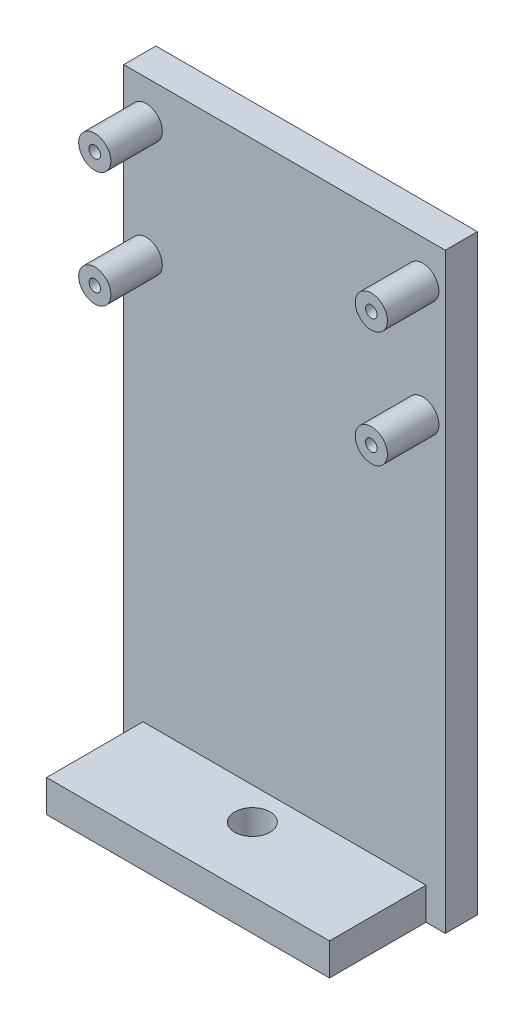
ISO-10303-21;
HEADER;
FILE_DESCRIPTION(('STEP AP214'),'2;1');
FILE_NAME('part.step','',(''),(''),'','','');
FILE_SCHEMA(('AUTOMOTIVE_DESIGN { 1 0 10303 214 1 1 1 1 }'));
ENDSEC;
DATA;
#1=APPLICATION_CONTEXT('core data for automotive mechanical design processes');
#2=APPLICATION_PROTOCOL_DEFINITION('international standard','automotive_design',2000,#1);
#3=PRODUCT_CONTEXT('',#1,'mechanical');
#4=PRODUCT('Part','Part','',(#3));
#5=PRODUCT_RELATED_PRODUCT_CATEGORY('part','',(#4));
#6=PRODUCT_DEFINITION_FORMATION('','',#4);
#7=PRODUCT_DEFINITION_CONTEXT('part definition',#1,'design');
#8=PRODUCT_DEFINITION('design','',#6,#7);
#9=PRODUCT_DEFINITION_SHAPE('','',#8);
#10=(LENGTH_UNIT() NAMED_UNIT(*) SI_UNIT(.MILLI.,.METRE.));
#11=(NAMED_UNIT(*) PLANE_ANGLE_UNIT() SI_UNIT($,.RADIAN.));
#12=(NAMED_UNIT(*) SI_UNIT($,.STERADIAN.) SOLID_ANGLE_UNIT());
#13=UNCERTAINTY_MEASURE_WITH_UNIT(LENGTH_MEASURE(1.E-05),#10,'distance_accuracy_value','');
#14=(GEOMETRIC_REPRESENTATION_CONTEXT(3) GLOBAL_UNCERTAINTY_ASSIGNED_CONTEXT((#13)) GLOBAL_UNIT_ASSIGNED_CONTEXT((#10,
#11,#12)) REPRESENTATION_CONTEXT('',''));
#15=CARTESIAN_POINT('',(0.,0.,0.));
#16=DIRECTION('',(0.,0.,1.));
#17=DIRECTION('',(1.,0.,0.));
#18=AXIS2_PLACEMENT_3D('',#15,#16,#17);
#19=CARTESIAN_POINT('',(25.,46.,5.));
#20=DIRECTION('',(-1.,0.,0.));
#21=DIRECTION('',(0.,-1.,0.));
#22=AXIS2_PLACEMENT_3D('',#19,#20,#21);
#23=PLANE('',#22);
#24=DIRECTION('',(0.,1.,0.));
#25=VECTOR('',#24,1.);
#26=CARTESIAN_POINT('',(25.,46.,0.));
#27=LINE('',#26,#25);
#28=CARTESIAN_POINT('',(25.,-46.,0.));
#29=VERTEX_POINT('',#28);
#30=CARTESIAN_POINT('',(25.,46.,0.));
#31=VERTEX_POINT('',#30);
#32=EDGE_CURVE('E123',#29,#31,#27,.T.);
#33=ORIENTED_EDGE('',*,*,#32,.T.);
#34=DIRECTION('',(0.,0.,-1.));
#35=VECTOR('',#34,1.);
#36=CARTESIAN_POINT('',(25.,46.,5.));
#37=LINE('',#36,#35);
#38=CARTESIAN_POINT('',(25.,46.,5.));
#39=VERTEX_POINT('',#38);
#40=EDGE_CURVE('E11',#39,#31,#37,.T.);
#41=ORIENTED_EDGE('',*,*,#40,.F.);
#42=DIRECTION('',(0.,1.,0.));
#43=VECTOR('',#42,1.);
#44=CARTESIAN_POINT('',(25.,46.,5.));
#45=LINE('',#44,#43);
#46=CARTESIAN_POINT('',(25.,-46.,5.));
#47=VERTEX_POINT('',#46);
#48=EDGE_CURVE('E132',#47,#39,#45,.T.);
#49=ORIENTED_EDGE('',*,*,#48,.F.);
#50=DIRECTION('',(0.,0.,-1.));
#51=VECTOR('',#50,1.);
#52=CARTESIAN_POINT('',(25.,-46.,5.));
#53=LINE('',#52,#51);
#54=EDGE_CURVE('E142',#47,#29,#53,.T.);
#55=ORIENTED_EDGE('',*,*,#54,.T.);
#56=EDGE_LOOP('',(#33,#41,#49,#55));
#57=FACE_BOUND('',#56,.T.);
#58=ADVANCED_FACE('F37',(#57),#23,.F.);
#59=CARTESIAN_POINT('',(-25.,46.,5.));
#60=DIRECTION('',(0.,-1.,0.));
#61=DIRECTION('',(0.,0.,-1.));
#62=AXIS2_PLACEMENT_3D('',#59,#60,#61);
#63=PLANE('',#62);
#64=DIRECTION('',(-1.,0.,0.));
#65=VECTOR('',#64,1.);
#66=CARTESIAN_POINT('',(-25.,46.,0.));
#67=LINE('',#66,#65);
#68=CARTESIAN_POINT('',(-25.,46.,0.));
#69=VERTEX_POINT('',#68);
#70=EDGE_CURVE('E126',#31,#69,#67,.T.);
#71=ORIENTED_EDGE('',*,*,#70,.T.);
#72=DIRECTION('',(0.,0.,-1.));
#73=VECTOR('',#72,1.);
#74=CARTESIAN_POINT('',(-25.,46.,5.));
#75=LINE('',#74,#73);
#76=CARTESIAN_POINT('',(-25.,46.,5.));
#77=VERTEX_POINT('',#76);
#78=EDGE_CURVE('E44',#77,#69,#75,.T.);
#79=ORIENTED_EDGE('',*,*,#78,.F.);
#80=DIRECTION('',(-1.,0.,0.));
#81=VECTOR('',#80,1.);
#82=CARTESIAN_POINT('',(-25.,46.,5.));
#83=LINE('',#82,#81);
#84=EDGE_CURVE('E135',#39,#77,#83,.T.);
#85=ORIENTED_EDGE('',*,*,#84,.F.);
#86=ORIENTED_EDGE('',*,*,#40,.T.);
#87=EDGE_LOOP('',(#71,#79,#85,#86));
#88=FACE_BOUND('',#87,.T.);
#89=ADVANCED_FACE('F195',(#88),#63,.F.);
#90=CARTESIAN_POINT('',(-25.,46.,5.));
#91=DIRECTION('',(1.,0.,0.));
#92=DIRECTION('',(0.,1.,0.));
#93=AXIS2_PLACEMENT_3D('',#90,#91,#92);
#94=PLANE('',#93);
#95=DIRECTION('',(0.,-1.,0.));
#96=VECTOR('',#95,1.);
#97=CARTESIAN_POINT('',(-25.,46.,0.));
#98=LINE('',#97,#96);
#99=CARTESIAN_POINT('',(-25.,-46.,0.));
#100=VERTEX_POINT('',#99);
#101=EDGE_CURVE('E145',#69,#100,#98,.T.);
#102=ORIENTED_EDGE('',*,*,#101,.T.);
#103=DIRECTION('',(0.,0.,-1.));
#104=VECTOR('',#103,1.);
#105=CARTESIAN_POINT('',(-25.,-46.,5.));
#106=LINE('',#105,#104);
#107=CARTESIAN_POINT('',(-25.,-46.,5.));
#108=VERTEX_POINT('',#107);
#109=EDGE_CURVE('E150',#108,#100,#106,.T.);
#110=ORIENTED_EDGE('',*,*,#109,.F.);
#111=DIRECTION('',(0.,-1.,0.));
#112=VECTOR('',#111,1.);
#113=CARTESIAN_POINT('',(-25.,46.,5.));
#114=LINE('',#113,#112);
#115=EDGE_CURVE('E138',#77,#108,#114,.T.);
#116=ORIENTED_EDGE('',*,*,#115,.F.);
#117=ORIENTED_EDGE('',*,*,#78,.T.);
#118=EDGE_LOOP('',(#102,#110,#116,#117));
#119=FACE_BOUND('',#118,.T.);
#120=ADVANCED_FACE('F157',(#119),#94,.F.);
#121=CARTESIAN_POINT('',(-25.,-46.,5.));
#122=DIRECTION('',(0.,1.,0.));
#123=DIRECTION('',(0.,0.,1.));
#124=AXIS2_PLACEMENT_3D('',#121,#122,#123);
#125=PLANE('',#124);
#126=CARTESIAN_POINT('',(0.,-46.,10.));
#127=DIRECTION('',(0.,1.,0.));
#128=DIRECTION('',(0.,0.,1.));
#129=AXIS2_PLACEMENT_3D('',#126,#127,#128);
#130=CIRCLE('',#129,2.75);
#131=CARTESIAN_POINT('',(0.,-46.,12.75));
#132=VERTEX_POINT('',#131);
#133=EDGE_CURVE('E178',#132,#132,#130,.T.);
#134=ORIENTED_EDGE('',*,*,#133,.T.);
#135=EDGE_LOOP('',(#134));
#136=FACE_BOUND('',#135,.T.);
#137=DIRECTION('',(1.,0.,0.));
#138=VECTOR('',#137,1.);
#139=CARTESIAN_POINT('',(-25.,-46.,0.));
#140=LINE('',#139,#138);
#141=EDGE_CURVE('E136',#100,#29,#140,.T.);
#142=ORIENTED_EDGE('',*,*,#141,.T.);
#143=ORIENTED_EDGE('',*,*,#54,.F.);
#144=DIRECTION('',(1.,0.,0.));
#145=VECTOR('',#144,1.);
#146=CARTESIAN_POINT('',(-25.,-46.,5.));
#147=LINE('',#146,#145);
#148=CARTESIAN_POINT('',(22.,-46.,5.));
#149=VERTEX_POINT('',#148);
#150=EDGE_CURVE('E140',#149,#47,#147,.T.);
#151=ORIENTED_EDGE('',*,*,#150,.F.);
#152=DIRECTION('',(0.,0.,-1.));
#153=VECTOR('',#152,1.);
#154=CARTESIAN_POINT('',(22.,-46.,20.));
#155=LINE('',#154,#153);
#156=CARTESIAN_POINT('',(22.,-46.,20.));
#157=VERTEX_POINT('',#156);
#158=EDGE_CURVE('E107',#157,#149,#155,.T.);
#159=ORIENTED_EDGE('',*,*,#158,.F.);
#160=DIRECTION('',(1.,0.,0.));
#161=VECTOR('',#160,1.);
#162=CARTESIAN_POINT('',(-22.,-46.,20.));
#163=LINE('',#162,#161);
#164=CARTESIAN_POINT('',(-22.,-46.,20.));
#165=VERTEX_POINT('',#164);
#166=EDGE_CURVE('E100',#165,#157,#163,.T.);
#167=ORIENTED_EDGE('',*,*,#166,.F.);
#168=DIRECTION('',(0.,0.,-1.));
#169=VECTOR('',#168,1.);
#170=CARTESIAN_POINT('',(-22.,-46.,20.));
#171=LINE('',#170,#169);
#172=CARTESIAN_POINT('',(-22.,-46.,5.));
#173=VERTEX_POINT('',#172);
#174=EDGE_CURVE('E105',#165,#173,#171,.T.);
#175=ORIENTED_EDGE('',*,*,#174,.T.);
#176=EDGE_CURVE('E141',#108,#173,#147,.T.);
#177=ORIENTED_EDGE('',*,*,#176,.F.);
#178=ORIENTED_EDGE('',*,*,#109,.T.);
#179=EDGE_LOOP('',(#142,#143,#151,#159,#167,#175,#177,#178));
#180=FACE_BOUND('',#179,.T.);
#181=ADVANCED_FACE('F102',(#136,#180),#125,.F.);
#182=CARTESIAN_POINT('',(0.,0.,5.));
#183=DIRECTION('',(0.,0.,1.));
#184=DIRECTION('',(1.,0.,0.));
#185=AXIS2_PLACEMENT_3D('',#182,#183,#184);
#186=PLANE('',#185);
#187=CARTESIAN_POINT('',(21.5,22.,5.));
#188=DIRECTION('',(0.,0.,1.));
#189=DIRECTION('',(1.,0.,0.));
#190=AXIS2_PLACEMENT_3D('',#187,#188,#189);
#191=CIRCLE('',#190,2.5);
#192=CARTESIAN_POINT('',(24.,22.,5.));
#193=VERTEX_POINT('',#192);
#194=EDGE_CURVE('E465',#193,#193,#191,.T.);
#195=ORIENTED_EDGE('',*,*,#194,.F.);
#196=EDGE_LOOP('',(#195));
#197=FACE_BOUND('',#196,.T.);
#198=CARTESIAN_POINT('',(21.5,40.,5.));
#199=DIRECTION('',(0.,0.,1.));
#200=DIRECTION('',(1.,0.,0.));
#201=AXIS2_PLACEMENT_3D('',#198,#199,#200);
#202=CIRCLE('',#201,2.5);
#203=CARTESIAN_POINT('',(24.,40.,5.));
#204=VERTEX_POINT('',#203);
#205=EDGE_CURVE('E474',#204,#204,#202,.T.);
#206=ORIENTED_EDGE('',*,*,#205,.F.);
#207=EDGE_LOOP('',(#206));
#208=FACE_BOUND('',#207,.T.);
#209=CARTESIAN_POINT('',(-21.5,22.,5.));
#210=DIRECTION('',(0.,0.,1.));
#211=DIRECTION('',(1.,0.,0.));
#212=AXIS2_PLACEMENT_3D('',#209,#210,#211);
#213=CIRCLE('',#212,2.5);
#214=CARTESIAN_POINT('',(-19.,22.,5.));
#215=VERTEX_POINT('',#214);
#216=EDGE_CURVE('E480',#215,#215,#213,.T.);
#217=ORIENTED_EDGE('',*,*,#216,.F.);
#218=EDGE_LOOP('',(#217));
#219=FACE_BOUND('',#218,.T.);
#220=CARTESIAN_POINT('',(-21.5,40.,5.));
#221=DIRECTION('',(0.,0.,1.));
#222=DIRECTION('',(1.,0.,0.));
#223=AXIS2_PLACEMENT_3D('',#220,#221,#222);
#224=CIRCLE('',#223,2.5);
#225=CARTESIAN_POINT('',(-19.,40.,5.));
#226=VERTEX_POINT('',#225);
#227=EDGE_CURVE('E483',#226,#226,#224,.T.);
#228=ORIENTED_EDGE('',*,*,#227,.F.);
#229=EDGE_LOOP('',(#228));
#230=FACE_BOUND('',#229,.T.);
#231=DIRECTION('',(0.,-1.,0.));
#232=VECTOR('',#231,1.);
#233=CARTESIAN_POINT('',(-22.,-46.,5.));
#234=LINE('',#233,#232);
#235=CARTESIAN_POINT('',(-22.,-41.,5.));
#236=VERTEX_POINT('',#235);
#237=EDGE_CURVE('E51',#236,#173,#234,.T.);
#238=ORIENTED_EDGE('',*,*,#237,.F.);
#239=DIRECTION('',(-1.,0.,0.));
#240=VECTOR('',#239,1.);
#241=CARTESIAN_POINT('',(-22.,-41.,5.));
#242=LINE('',#241,#240);
#243=CARTESIAN_POINT('',(22.,-41.,5.));
#244=VERTEX_POINT('',#243);
#245=EDGE_CURVE('E120',#244,#236,#242,.T.);
#246=ORIENTED_EDGE('',*,*,#245,.F.);
#247=DIRECTION('',(0.,1.,0.));
#248=VECTOR('',#247,1.);
#249=CARTESIAN_POINT('',(22.,-46.,5.));
#250=LINE('',#249,#248);
#251=EDGE_CURVE('E57',#149,#244,#250,.T.);
#252=ORIENTED_EDGE('',*,*,#251,.F.);
#253=ORIENTED_EDGE('',*,*,#150,.T.);
#254=ORIENTED_EDGE('',*,*,#48,.T.);
#255=ORIENTED_EDGE('',*,*,#84,.T.);
#256=ORIENTED_EDGE('',*,*,#115,.T.);
#257=ORIENTED_EDGE('',*,*,#176,.T.);
#258=EDGE_LOOP('',(#238,#246,#252,#253,#254,#255,#256,#257));
#259=FACE_BOUND('',#258,.T.);
#260=ADVANCED_FACE('F168',(#197,#208,#219,#230,#259),#186,.T.);
#261=CARTESIAN_POINT('',(0.,0.,0.));
#262=DIRECTION('',(0.,0.,1.));
#263=DIRECTION('',(1.,0.,0.));
#264=AXIS2_PLACEMENT_3D('',#261,#262,#263);
#265=PLANE('',#264);
#266=CARTESIAN_POINT('',(-21.5,40.,0.));
#267=DIRECTION('',(0.,0.,1.));
#268=DIRECTION('',(1.,0.,0.));
#269=AXIS2_PLACEMENT_3D('',#266,#267,#268);
#270=CIRCLE('',#269,0.899999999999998);
#271=CARTESIAN_POINT('',(-20.6,40.,0.));
#272=VERTEX_POINT('',#271);
#273=EDGE_CURVE('E489',#272,#272,#270,.T.);
#274=ORIENTED_EDGE('',*,*,#273,.T.);
#275=EDGE_LOOP('',(#274));
#276=FACE_BOUND('',#275,.T.);
#277=CARTESIAN_POINT('',(21.5,40.,0.));
#278=DIRECTION('',(0.,0.,1.));
#279=DIRECTION('',(1.,0.,0.));
#280=AXIS2_PLACEMENT_3D('',#277,#278,#279);
#281=CIRCLE('',#280,0.899999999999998);
#282=CARTESIAN_POINT('',(22.4,40.,0.));
#283=VERTEX_POINT('',#282);
#284=EDGE_CURVE('E494',#283,#283,#281,.T.);
#285=ORIENTED_EDGE('',*,*,#284,.T.);
#286=EDGE_LOOP('',(#285));
#287=FACE_BOUND('',#286,.T.);
#288=CARTESIAN_POINT('',(21.5,22.,0.));
#289=DIRECTION('',(0.,0.,1.));
#290=DIRECTION('',(1.,0.,0.));
#291=AXIS2_PLACEMENT_3D('',#288,#289,#290);
#292=CIRCLE('',#291,0.899999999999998);
#293=CARTESIAN_POINT('',(22.4,22.,0.));
#294=VERTEX_POINT('',#293);
#295=EDGE_CURVE('E497',#294,#294,#292,.T.);
#296=ORIENTED_EDGE('',*,*,#295,.T.);
#297=EDGE_LOOP('',(#296));
#298=FACE_BOUND('',#297,.T.);
#299=CARTESIAN_POINT('',(-21.5,22.,0.));
#300=DIRECTION('',(0.,0.,1.));
#301=DIRECTION('',(1.,0.,0.));
#302=AXIS2_PLACEMENT_3D('',#299,#300,#301);
#303=CIRCLE('',#302,0.899999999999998);
#304=CARTESIAN_POINT('',(-20.6,22.,0.));
#305=VERTEX_POINT('',#304);
#306=EDGE_CURVE('E500',#305,#305,#303,.T.);
#307=ORIENTED_EDGE('',*,*,#306,.T.);
#308=EDGE_LOOP('',(#307));
#309=FACE_BOUND('',#308,.T.);
#310=ORIENTED_EDGE('',*,*,#32,.F.);
#311=ORIENTED_EDGE('',*,*,#141,.F.);
#312=ORIENTED_EDGE('',*,*,#101,.F.);
#313=ORIENTED_EDGE('',*,*,#70,.F.);
#314=EDGE_LOOP('',(#310,#311,#312,#313));
#315=FACE_BOUND('',#314,.T.);
#316=ADVANCED_FACE('F163',(#276,#287,#298,#309,#315),#265,.F.);
#317=CARTESIAN_POINT('',(-22.,-46.,20.));
#318=DIRECTION('',(1.,0.,0.));
#319=DIRECTION('',(0.,0.,-1.));
#320=AXIS2_PLACEMENT_3D('',#317,#318,#319);
#321=PLANE('',#320);
#322=ORIENTED_EDGE('',*,*,#237,.T.);
#323=ORIENTED_EDGE('',*,*,#174,.F.);
#324=DIRECTION('',(0.,-1.,0.));
#325=VECTOR('',#324,1.);
#326=CARTESIAN_POINT('',(-22.,-46.,20.));
#327=LINE('',#326,#325);
#328=CARTESIAN_POINT('',(-22.,-41.,20.));
#329=VERTEX_POINT('',#328);
#330=EDGE_CURVE('E111',#329,#165,#327,.T.);
#331=ORIENTED_EDGE('',*,*,#330,.F.);
#332=DIRECTION('',(0.,0.,-1.));
#333=VECTOR('',#332,1.);
#334=CARTESIAN_POINT('',(-22.,-41.,20.));
#335=LINE('',#334,#333);
#336=EDGE_CURVE('E174',#329,#236,#335,.T.);
#337=ORIENTED_EDGE('',*,*,#336,.T.);
#338=EDGE_LOOP('',(#322,#323,#331,#337));
#339=FACE_BOUND('',#338,.T.);
#340=ADVANCED_FACE('F122',(#339),#321,.F.);
#341=CARTESIAN_POINT('',(22.,-46.,20.));
#342=DIRECTION('',(-1.,0.,0.));
#343=DIRECTION('',(0.,0.,1.));
#344=AXIS2_PLACEMENT_3D('',#341,#342,#343);
#345=PLANE('',#344);
#346=ORIENTED_EDGE('',*,*,#251,.T.);
#347=DIRECTION('',(0.,0.,-1.));
#348=VECTOR('',#347,1.);
#349=CARTESIAN_POINT('',(22.,-41.,20.));
#350=LINE('',#349,#348);
#351=CARTESIAN_POINT('',(22.,-41.,20.));
#352=VERTEX_POINT('',#351);
#353=EDGE_CURVE('E128',#352,#244,#350,.T.);
#354=ORIENTED_EDGE('',*,*,#353,.F.);
#355=DIRECTION('',(0.,1.,0.));
#356=VECTOR('',#355,1.);
#357=CARTESIAN_POINT('',(22.,-46.,20.));
#358=LINE('',#357,#356);
#359=EDGE_CURVE('E110',#157,#352,#358,.T.);
#360=ORIENTED_EDGE('',*,*,#359,.F.);
#361=ORIENTED_EDGE('',*,*,#158,.T.);
#362=EDGE_LOOP('',(#346,#354,#360,#361));
#363=FACE_BOUND('',#362,.T.);
#364=ADVANCED_FACE('F170',(#363),#345,.F.);
#365=CARTESIAN_POINT('',(-22.,-41.,20.));
#366=DIRECTION('',(0.,-1.,0.));
#367=DIRECTION('',(0.,0.,-1.));
#368=AXIS2_PLACEMENT_3D('',#365,#366,#367);
#369=PLANE('',#368);
#370=CARTESIAN_POINT('',(0.,-41.,10.));
#371=DIRECTION('',(0.,1.,0.));
#372=DIRECTION('',(0.,0.,1.));
#373=AXIS2_PLACEMENT_3D('',#370,#371,#372);
#374=CIRCLE('',#373,2.75);
#375=CARTESIAN_POINT('',(0.,-41.,12.75));
#376=VERTEX_POINT('',#375);
#377=EDGE_CURVE('E503',#376,#376,#374,.T.);
#378=ORIENTED_EDGE('',*,*,#377,.F.);
#379=EDGE_LOOP('',(#378));
#380=FACE_BOUND('',#379,.T.);
#381=ORIENTED_EDGE('',*,*,#245,.T.);
#382=ORIENTED_EDGE('',*,*,#336,.F.);
#383=DIRECTION('',(-1.,0.,0.));
#384=VECTOR('',#383,1.);
#385=CARTESIAN_POINT('',(-22.,-41.,20.));
#386=LINE('',#385,#384);
#387=EDGE_CURVE('E116',#352,#329,#386,.T.);
#388=ORIENTED_EDGE('',*,*,#387,.F.);
#389=ORIENTED_EDGE('',*,*,#353,.T.);
#390=EDGE_LOOP('',(#381,#382,#388,#389));
#391=FACE_BOUND('',#390,.T.);
#392=ADVANCED_FACE('F182',(#380,#391),#369,.F.);
#393=CARTESIAN_POINT('',(0.,0.,20.));
#394=DIRECTION('',(0.,0.,-1.));
#395=DIRECTION('',(-1.,0.,0.));
#396=AXIS2_PLACEMENT_3D('',#393,#394,#395);
#397=PLANE('',#396);
#398=ORIENTED_EDGE('',*,*,#330,.T.);
#399=ORIENTED_EDGE('',*,*,#166,.T.);
#400=ORIENTED_EDGE('',*,*,#359,.T.);
#401=ORIENTED_EDGE('',*,*,#387,.T.);
#402=EDGE_LOOP('',(#398,#399,#400,#401));
#403=FACE_BOUND('',#402,.T.);
#404=ADVANCED_FACE('F114',(#403),#397,.F.);
#405=CARTESIAN_POINT('',(0.,-41.,10.));
#406=DIRECTION('',(0.,1.,0.));
#407=DIRECTION('',(0.,0.,1.));
#408=AXIS2_PLACEMENT_3D('',#405,#406,#407);
#409=CYLINDRICAL_SURFACE('',#408,2.75);
#410=ORIENTED_EDGE('',*,*,#133,.F.);
#411=EDGE_LOOP('',(#410));
#412=FACE_BOUND('',#411,.T.);
#413=ORIENTED_EDGE('',*,*,#377,.T.);
#414=EDGE_LOOP('',(#413));
#415=FACE_BOUND('',#414,.T.);
#416=ADVANCED_FACE('F190',(#412,#415),#409,.F.);
#417=CARTESIAN_POINT('',(-21.5,22.,5.));
#418=DIRECTION('',(0.,0.,1.));
#419=DIRECTION('',(1.,0.,0.));
#420=AXIS2_PLACEMENT_3D('',#417,#418,#419);
#421=CYLINDRICAL_SURFACE('',#420,0.899999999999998);
#422=ORIENTED_EDGE('',*,*,#306,.F.);
#423=EDGE_LOOP('',(#422));
#424=FACE_BOUND('',#423,.T.);
#425=CARTESIAN_POINT('',(-21.5,22.,13.));
#426=DIRECTION('',(0.,0.,1.));
#427=DIRECTION('',(1.,0.,0.));
#428=AXIS2_PLACEMENT_3D('',#425,#426,#427);
#429=CIRCLE('',#428,0.899999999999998);
#430=CARTESIAN_POINT('',(-20.6,22.,13.));
#431=VERTEX_POINT('',#430);
#432=EDGE_CURVE('E466',#431,#431,#429,.T.);
#433=ORIENTED_EDGE('',*,*,#432,.T.);
#434=EDGE_LOOP('',(#433));
#435=FACE_BOUND('',#434,.T.);
#436=ADVANCED_FACE('F252',(#424,#435),#421,.F.);
#437=CARTESIAN_POINT('',(21.5,22.,5.));
#438=DIRECTION('',(0.,0.,1.));
#439=DIRECTION('',(1.,0.,0.));
#440=AXIS2_PLACEMENT_3D('',#437,#438,#439);
#441=CYLINDRICAL_SURFACE('',#440,0.899999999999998);
#442=ORIENTED_EDGE('',*,*,#295,.F.);
#443=EDGE_LOOP('',(#442));
#444=FACE_BOUND('',#443,.T.);
#445=CARTESIAN_POINT('',(21.5,22.,13.));
#446=DIRECTION('',(0.,0.,1.));
#447=DIRECTION('',(1.,0.,0.));
#448=AXIS2_PLACEMENT_3D('',#445,#446,#447);
#449=CIRCLE('',#448,0.899999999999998);
#450=CARTESIAN_POINT('',(22.4,22.,13.));
#451=VERTEX_POINT('',#450);
#452=EDGE_CURVE('E461',#451,#451,#449,.T.);
#453=ORIENTED_EDGE('',*,*,#452,.T.);
#454=EDGE_LOOP('',(#453));
#455=FACE_BOUND('',#454,.T.);
#456=ADVANCED_FACE('F335',(#444,#455),#441,.F.);
#457=CARTESIAN_POINT('',(21.5,40.,5.));
#458=DIRECTION('',(0.,0.,1.));
#459=DIRECTION('',(1.,0.,0.));
#460=AXIS2_PLACEMENT_3D('',#457,#458,#459);
#461=CYLINDRICAL_SURFACE('',#460,0.899999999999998);
#462=ORIENTED_EDGE('',*,*,#284,.F.);
#463=EDGE_LOOP('',(#462));
#464=FACE_BOUND('',#463,.T.);
#465=CARTESIAN_POINT('',(21.5,40.,13.));
#466=DIRECTION('',(0.,0.,1.));
#467=DIRECTION('',(1.,0.,0.));
#468=AXIS2_PLACEMENT_3D('',#465,#466,#467);
#469=CIRCLE('',#468,0.899999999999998);
#470=CARTESIAN_POINT('',(22.4,40.,13.));
#471=VERTEX_POINT('',#470);
#472=EDGE_CURVE('E524',#471,#471,#469,.T.);
#473=ORIENTED_EDGE('',*,*,#472,.T.);
#474=EDGE_LOOP('',(#473));
#475=FACE_BOUND('',#474,.T.);
#476=ADVANCED_FACE('F345',(#464,#475),#461,.F.);
#477=CARTESIAN_POINT('',(-21.5,40.,5.));
#478=DIRECTION('',(0.,0.,1.));
#479=DIRECTION('',(1.,0.,0.));
#480=AXIS2_PLACEMENT_3D('',#477,#478,#479);
#481=CYLINDRICAL_SURFACE('',#480,0.899999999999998);
#482=ORIENTED_EDGE('',*,*,#273,.F.);
#483=EDGE_LOOP('',(#482));
#484=FACE_BOUND('',#483,.T.);
#485=CARTESIAN_POINT('',(-21.5,40.,13.));
#486=DIRECTION('',(0.,0.,1.));
#487=DIRECTION('',(1.,0.,0.));
#488=AXIS2_PLACEMENT_3D('',#485,#486,#487);
#489=CIRCLE('',#488,0.899999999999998);
#490=CARTESIAN_POINT('',(-20.6,40.,13.));
#491=VERTEX_POINT('',#490);
#492=EDGE_CURVE('E527',#491,#491,#489,.T.);
#493=ORIENTED_EDGE('',*,*,#492,.T.);
#494=EDGE_LOOP('',(#493));
#495=FACE_BOUND('',#494,.T.);
#496=ADVANCED_FACE('F279',(#484,#495),#481,.F.);
#497=CARTESIAN_POINT('',(-21.5,40.,13.));
#498=DIRECTION('',(0.,0.,-1.));
#499=DIRECTION('',(-1.,0.,0.));
#500=AXIS2_PLACEMENT_3D('',#497,#498,#499);
#501=CYLINDRICAL_SURFACE('',#500,2.5);
#502=CARTESIAN_POINT('',(-21.5,40.,13.));
#503=DIRECTION('',(0.,0.,1.));
#504=DIRECTION('',(1.,0.,0.));
#505=AXIS2_PLACEMENT_3D('',#502,#503,#504);
#506=CIRCLE('',#505,2.5);
#507=CARTESIAN_POINT('',(-19.,40.,13.));
#508=VERTEX_POINT('',#507);
#509=EDGE_CURVE('E486',#508,#508,#506,.T.);
#510=ORIENTED_EDGE('',*,*,#509,.F.);
#511=EDGE_LOOP('',(#510));
#512=FACE_BOUND('',#511,.T.);
#513=ORIENTED_EDGE('',*,*,#227,.T.);
#514=EDGE_LOOP('',(#513));
#515=FACE_BOUND('',#514,.T.);
#516=ADVANCED_FACE('F273',(#512,#515),#501,.T.);
#517=CARTESIAN_POINT('',(-21.5,40.,13.));
#518=DIRECTION('',(0.,0.,1.));
#519=DIRECTION('',(1.,0.,0.));
#520=AXIS2_PLACEMENT_3D('',#517,#518,#519);
#521=PLANE('',#520);
#522=ORIENTED_EDGE('',*,*,#492,.F.);
#523=EDGE_LOOP('',(#522));
#524=FACE_BOUND('',#523,.T.);
#525=ORIENTED_EDGE('',*,*,#509,.T.);
#526=EDGE_LOOP('',(#525));
#527=FACE_BOUND('',#526,.T.);
#528=ADVANCED_FACE('F278',(#524,#527),#521,.T.);
#529=CARTESIAN_POINT('',(-21.5,22.,13.));
#530=DIRECTION('',(0.,0.,-1.));
#531=DIRECTION('',(-1.,0.,0.));
#532=AXIS2_PLACEMENT_3D('',#529,#530,#531);
#533=CYLINDRICAL_SURFACE('',#532,2.5);
#534=CARTESIAN_POINT('',(-21.5,22.,13.));
#535=DIRECTION('',(0.,0.,1.));
#536=DIRECTION('',(1.,0.,0.));
#537=AXIS2_PLACEMENT_3D('',#534,#535,#536);
#538=CIRCLE('',#537,2.5);
#539=CARTESIAN_POINT('',(-19.,22.,13.));
#540=VERTEX_POINT('',#539);
#541=EDGE_CURVE('E477',#540,#540,#538,.T.);
#542=ORIENTED_EDGE('',*,*,#541,.F.);
#543=EDGE_LOOP('',(#542));
#544=FACE_BOUND('',#543,.T.);
#545=ORIENTED_EDGE('',*,*,#216,.T.);
#546=EDGE_LOOP('',(#545));
#547=FACE_BOUND('',#546,.T.);
#548=ADVANCED_FACE('F290',(#544,#547),#533,.T.);
#549=CARTESIAN_POINT('',(-21.5,22.,13.));
#550=DIRECTION('',(0.,0.,1.));
#551=DIRECTION('',(1.,0.,0.));
#552=AXIS2_PLACEMENT_3D('',#549,#550,#551);
#553=PLANE('',#552);
#554=ORIENTED_EDGE('',*,*,#432,.F.);
#555=EDGE_LOOP('',(#554));
#556=FACE_BOUND('',#555,.T.);
#557=ORIENTED_EDGE('',*,*,#541,.T.);
#558=EDGE_LOOP('',(#557));
#559=FACE_BOUND('',#558,.T.);
#560=ADVANCED_FACE('F295',(#556,#559),#553,.T.);
#561=CARTESIAN_POINT('',(21.5,40.,13.));
#562=DIRECTION('',(0.,0.,-1.));
#563=DIRECTION('',(-1.,0.,0.));
#564=AXIS2_PLACEMENT_3D('',#561,#562,#563);
#565=CYLINDRICAL_SURFACE('',#564,2.5);
#566=CARTESIAN_POINT('',(21.5,40.,13.));
#567=DIRECTION('',(0.,0.,1.));
#568=DIRECTION('',(1.,0.,0.));
#569=AXIS2_PLACEMENT_3D('',#566,#567,#568);
#570=CIRCLE('',#569,2.5);
#571=CARTESIAN_POINT('',(24.,40.,13.));
#572=VERTEX_POINT('',#571);
#573=EDGE_CURVE('E469',#572,#572,#570,.T.);
#574=ORIENTED_EDGE('',*,*,#573,.F.);
#575=EDGE_LOOP('',(#574));
#576=FACE_BOUND('',#575,.T.);
#577=ORIENTED_EDGE('',*,*,#205,.T.);
#578=EDGE_LOOP('',(#577));
#579=FACE_BOUND('',#578,.T.);
#580=ADVANCED_FACE('F304',(#576,#579),#565,.T.);
#581=CARTESIAN_POINT('',(21.5,40.,13.));
#582=DIRECTION('',(0.,0.,1.));
#583=DIRECTION('',(1.,0.,0.));
#584=AXIS2_PLACEMENT_3D('',#581,#582,#583);
#585=PLANE('',#584);
#586=ORIENTED_EDGE('',*,*,#472,.F.);
#587=EDGE_LOOP('',(#586));
#588=FACE_BOUND('',#587,.T.);
#589=ORIENTED_EDGE('',*,*,#573,.T.);
#590=EDGE_LOOP('',(#589));
#591=FACE_BOUND('',#590,.T.);
#592=ADVANCED_FACE('F309',(#588,#591),#585,.T.);
#593=CARTESIAN_POINT('',(21.5,22.,13.));
#594=DIRECTION('',(0.,0.,-1.));
#595=DIRECTION('',(-1.,0.,0.));
#596=AXIS2_PLACEMENT_3D('',#593,#594,#595);
#597=CYLINDRICAL_SURFACE('',#596,2.5);
#598=CARTESIAN_POINT('',(21.5,22.,13.));
#599=DIRECTION('',(0.,0.,1.));
#600=DIRECTION('',(1.,0.,0.));
#601=AXIS2_PLACEMENT_3D('',#598,#599,#600);
#602=CIRCLE('',#601,2.5);
#603=CARTESIAN_POINT('',(24.,22.,13.));
#604=VERTEX_POINT('',#603);
#605=EDGE_CURVE('E464',#604,#604,#602,.T.);
#606=ORIENTED_EDGE('',*,*,#605,.F.);
#607=EDGE_LOOP('',(#606));
#608=FACE_BOUND('',#607,.T.);
#609=ORIENTED_EDGE('',*,*,#194,.T.);
#610=EDGE_LOOP('',(#609));
#611=FACE_BOUND('',#610,.T.);
#612=ADVANCED_FACE('F318',(#608,#611),#597,.T.);
#613=CARTESIAN_POINT('',(21.5,22.,13.));
#614=DIRECTION('',(0.,0.,1.));
#615=DIRECTION('',(1.,0.,0.));
#616=AXIS2_PLACEMENT_3D('',#613,#614,#615);
#617=PLANE('',#616);
#618=ORIENTED_EDGE('',*,*,#452,.F.);
#619=EDGE_LOOP('',(#618));
#620=FACE_BOUND('',#619,.T.);
#621=ORIENTED_EDGE('',*,*,#605,.T.);
#622=EDGE_LOOP('',(#621));
#623=FACE_BOUND('',#622,.T.);
#624=ADVANCED_FACE('F323',(#620,#623),#617,.T.);
#625=CLOSED_SHELL('',(#58,#89,#120,#181,#260,#316,#340,#364,#392,#404,#416,#436,#456,#476,#496,
#516,#528,#548,#560,#580,#592,#612,#624));
#626=MANIFOLD_SOLID_BREP('B2',#625);
#627=ADVANCED_BREP_SHAPE_REPRESENTATION('',(#18,#626),#14);
#628=SHAPE_DEFINITION_REPRESENTATION(#9,#627);
ENDSEC;
END-ISO-10303-21;
